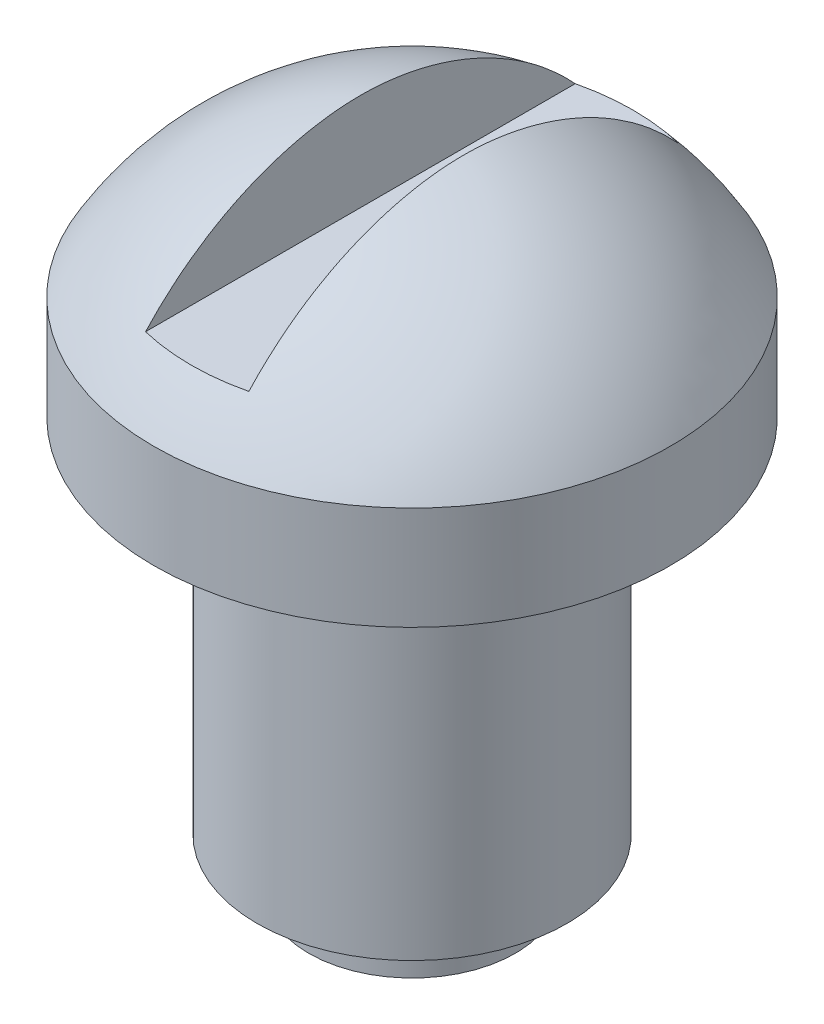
from build123d import *

# Parameters (mm, degrees)
SKETCH2_W          = 2
SKETCH2_H          = 4.935014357
CUT_EXTRUDE1_DEPTH = 5


with BuildPart() as part:
    # Sketch1 → Revolve1 (revolve)
    with BuildSketch(Plane.XY, mode=Mode.PRIVATE) as revolve1_sk:
        with BuildLine():
            Line((0, 0), (2, 0))
            Line((2, 0), (2, 1))
            Line((2, 1), (3, 1))
            Line((3, 1), (3, 8))
            Line((3, 8), (5, 8))
            Line((5, 8), (5, 10))
            ThreePointArc((5, 10), (2.888936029, 12.148226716), (0, 13))
            Line((0, 13), (0, 0))
        make_face()
    revolve(revolve1_sk.sketch.rotate(Axis((0, 0, 0), (0, -1, 0)), 90), axis=Axis((0, 0, 0), (0, -1, 0)))

    # Sketch2 → Cut-Extrude1 (cut, symmetric)
    with BuildSketch(Plane.XY):
        with Locations((0, 13.467507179)):
            Rectangle(SKETCH2_W, SKETCH2_H)
    extrude(amount=CUT_EXTRUDE1_DEPTH, both=True, mode=Mode.SUBTRACT)


solid = part.part
